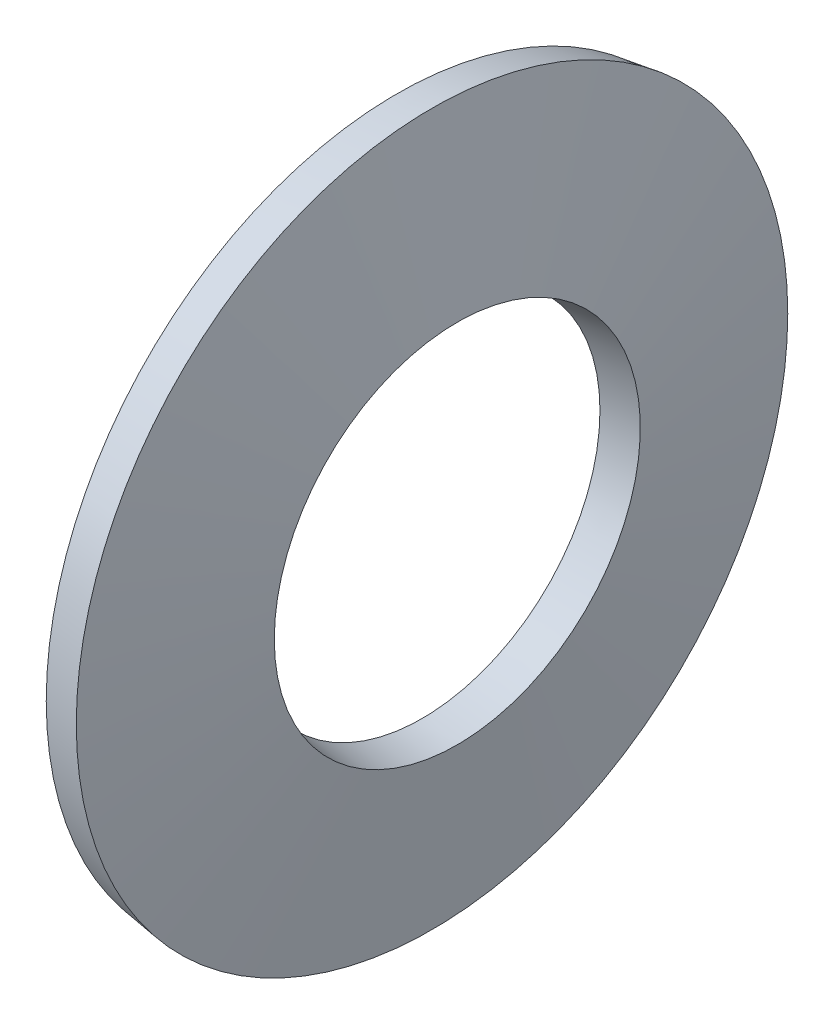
from build123d import *


with BuildPart() as part:
    # Esquisse1 → Base-R_volution (revolve)
    with BuildSketch(Plane.XY, mode=Mode.PRIVATE) as base_r_volution_sk:
        Polygon((0, 19.710392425), (1.42107922, 10), (3.4, 10.289607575), (1.97892078, 20), align=None)
    revolve(base_r_volution_sk.sketch.rotate(Axis((0, 0, 0), (1, 0, 0)), 90), axis=Axis((0, 0, 0), (1, 0, 0)))


solid = part.part
